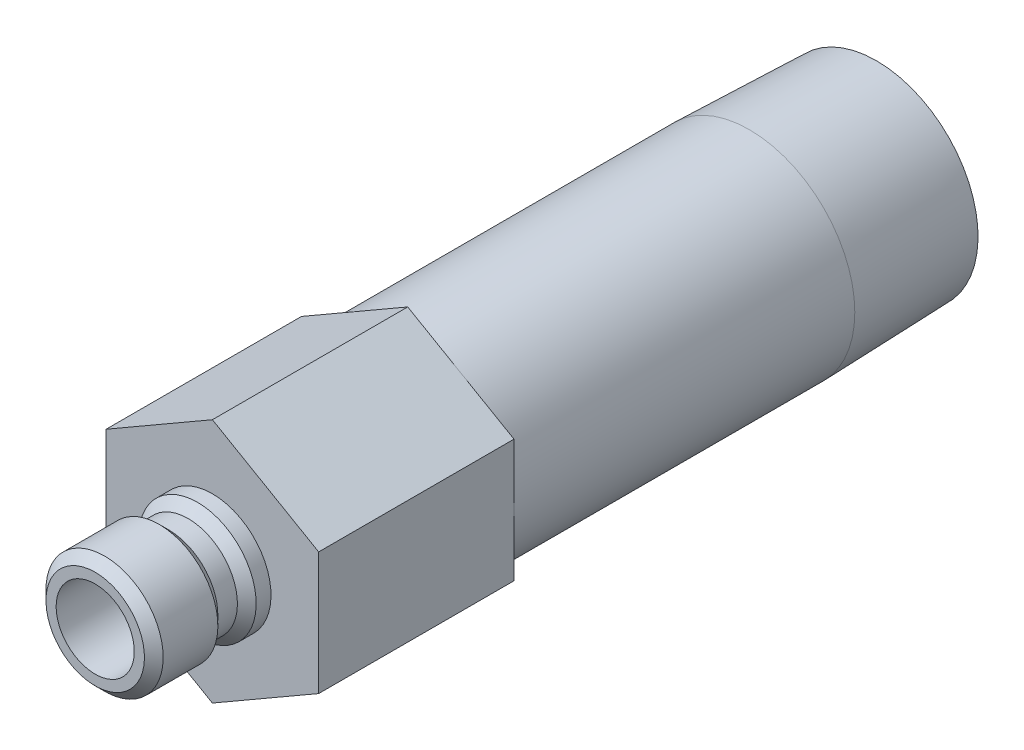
ISO-10303-21;
HEADER;
FILE_DESCRIPTION(('STEP AP214'),'2;1');
FILE_NAME('part.step','',(''),(''),'','','');
FILE_SCHEMA(('AUTOMOTIVE_DESIGN { 1 0 10303 214 1 1 1 1 }'));
ENDSEC;
DATA;
#1=APPLICATION_CONTEXT('core data for automotive mechanical design processes');
#2=APPLICATION_PROTOCOL_DEFINITION('international standard','automotive_design',2000,#1);
#3=PRODUCT_CONTEXT('',#1,'mechanical');
#4=PRODUCT('Part','Part','',(#3));
#5=PRODUCT_RELATED_PRODUCT_CATEGORY('part','',(#4));
#6=PRODUCT_DEFINITION_FORMATION('','',#4);
#7=PRODUCT_DEFINITION_CONTEXT('part definition',#1,'design');
#8=PRODUCT_DEFINITION('design','',#6,#7);
#9=PRODUCT_DEFINITION_SHAPE('','',#8);
#10=(LENGTH_UNIT() NAMED_UNIT(*) SI_UNIT(.MILLI.,.METRE.));
#11=(NAMED_UNIT(*) PLANE_ANGLE_UNIT() SI_UNIT($,.RADIAN.));
#12=(NAMED_UNIT(*) SI_UNIT($,.STERADIAN.) SOLID_ANGLE_UNIT());
#13=UNCERTAINTY_MEASURE_WITH_UNIT(LENGTH_MEASURE(1.E-05),#10,'distance_accuracy_value','');
#14=(GEOMETRIC_REPRESENTATION_CONTEXT(3) GLOBAL_UNCERTAINTY_ASSIGNED_CONTEXT((#13)) GLOBAL_UNIT_ASSIGNED_CONTEXT((#10,
#11,#12)) REPRESENTATION_CONTEXT('',''));
#15=CARTESIAN_POINT('',(0.,0.,0.));
#16=DIRECTION('',(0.,0.,1.));
#17=DIRECTION('',(1.,0.,0.));
#18=AXIS2_PLACEMENT_3D('',#15,#16,#17);
#19=CARTESIAN_POINT('',(0.,0.,0.));
#20=DIRECTION('',(0.,0.,-1.));
#21=DIRECTION('',(0.,1.,0.));
#22=AXIS2_PLACEMENT_3D('',#19,#20,#21);
#23=CYLINDRICAL_SURFACE('',#22,8.5725);
#24=CARTESIAN_POINT('',(0.,0.,-43.6372));
#25=DIRECTION('',(0.,0.,-1.));
#26=DIRECTION('',(0.,1.,0.));
#27=AXIS2_PLACEMENT_3D('',#24,#25,#26);
#28=CIRCLE('',#27,8.57249999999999);
#29=CARTESIAN_POINT('',(0.,8.5725,-43.6372));
#30=VERTEX_POINT('',#29);
#31=EDGE_CURVE('E168',#30,#30,#28,.T.);
#32=ORIENTED_EDGE('',*,*,#31,.F.);
#33=EDGE_LOOP('',(#32));
#34=FACE_BOUND('',#33,.T.);
#35=CARTESIAN_POINT('',(0.,0.,-15.875));
#36=DIRECTION('',(0.,0.,1.));
#37=DIRECTION('',(1.,0.,0.));
#38=AXIS2_PLACEMENT_3D('',#35,#36,#37);
#39=CIRCLE('',#38,8.5725);
#40=CARTESIAN_POINT('',(8.5725,0.,-15.875));
#41=VERTEX_POINT('',#40);
#42=EDGE_CURVE('E37',#41,#41,#39,.F.);
#43=ORIENTED_EDGE('',*,*,#42,.T.);
#44=EDGE_LOOP('',(#43));
#45=FACE_BOUND('',#44,.T.);
#46=ADVANCED_FACE('F33',(#34,#45),#23,.T.);
#47=CARTESIAN_POINT('',(0.,0.,0.));
#48=DIRECTION('',(0.,0.,-1.));
#49=DIRECTION('',(0.,1.,0.));
#50=AXIS2_PLACEMENT_3D('',#47,#48,#49);
#51=CYLINDRICAL_SURFACE('',#50,3.175);
#52=CARTESIAN_POINT('',(0.,0.,9.525));
#53=DIRECTION('',(0.,0.,-1.));
#54=DIRECTION('',(0.,1.,0.));
#55=AXIS2_PLACEMENT_3D('',#52,#53,#54);
#56=CIRCLE('',#55,3.175);
#57=CARTESIAN_POINT('',(0.,3.175,9.525));
#58=VERTEX_POINT('',#57);
#59=EDGE_CURVE('E144',#58,#58,#56,.T.);
#60=ORIENTED_EDGE('',*,*,#59,.F.);
#61=EDGE_LOOP('',(#60));
#62=FACE_BOUND('',#61,.T.);
#63=CARTESIAN_POINT('',(0.,0.,-15.875));
#64=DIRECTION('',(0.,0.,-1.));
#65=DIRECTION('',(0.,1.,0.));
#66=AXIS2_PLACEMENT_3D('',#63,#64,#65);
#67=CIRCLE('',#66,3.17499999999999);
#68=CARTESIAN_POINT('',(0.,3.175,-15.875));
#69=VERTEX_POINT('',#68);
#70=EDGE_CURVE('E11',#69,#69,#67,.T.);
#71=ORIENTED_EDGE('',*,*,#70,.T.);
#72=EDGE_LOOP('',(#71));
#73=FACE_BOUND('',#72,.T.);
#74=ADVANCED_FACE('F35',(#62,#73),#51,.F.);
#75=CARTESIAN_POINT('',(0.,3.175,-15.875));
#76=DIRECTION('',(0.,0.,-1.));
#77=DIRECTION('',(0.,1.,0.));
#78=AXIS2_PLACEMENT_3D('',#75,#76,#77);
#79=PLANE('',#78);
#80=CARTESIAN_POINT('',(0.,0.,-15.875));
#81=DIRECTION('',(0.,0.,-1.));
#82=DIRECTION('',(0.,1.,0.));
#83=AXIS2_PLACEMENT_3D('',#80,#81,#82);
#84=CIRCLE('',#83,6.2611);
#85=CARTESIAN_POINT('',(0.,6.2611,-15.875));
#86=VERTEX_POINT('',#85);
#87=EDGE_CURVE('E43',#86,#86,#84,.T.);
#88=ORIENTED_EDGE('',*,*,#87,.T.);
#89=EDGE_LOOP('',(#88));
#90=FACE_BOUND('',#89,.T.);
#91=ORIENTED_EDGE('',*,*,#70,.F.);
#92=EDGE_LOOP('',(#91));
#93=FACE_BOUND('',#92,.T.);
#94=ADVANCED_FACE('F180',(#90,#93),#79,.T.);
#95=CARTESIAN_POINT('',(0.,0.,0.));
#96=DIRECTION('',(0.,0.,-1.));
#97=DIRECTION('',(0.,1.,0.));
#98=AXIS2_PLACEMENT_3D('',#95,#96,#97);
#99=CYLINDRICAL_SURFACE('',#98,6.2611);
#100=CARTESIAN_POINT('',(0.,0.,-53.975));
#101=DIRECTION('',(0.,0.,-1.));
#102=DIRECTION('',(0.,1.,0.));
#103=AXIS2_PLACEMENT_3D('',#100,#101,#102);
#104=CIRCLE('',#103,6.26109999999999);
#105=CARTESIAN_POINT('',(0.,6.2611,-53.975));
#106=VERTEX_POINT('',#105);
#107=EDGE_CURVE('E174',#106,#106,#104,.T.);
#108=ORIENTED_EDGE('',*,*,#107,.T.);
#109=EDGE_LOOP('',(#108));
#110=FACE_BOUND('',#109,.T.);
#111=ORIENTED_EDGE('',*,*,#87,.F.);
#112=EDGE_LOOP('',(#111));
#113=FACE_BOUND('',#112,.T.);
#114=ADVANCED_FACE('F183',(#110,#113),#99,.F.);
#115=CARTESIAN_POINT('',(0.,8.24944566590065,-53.975));
#116=DIRECTION('',(0.,0.,-1.));
#117=DIRECTION('',(0.,1.,0.));
#118=AXIS2_PLACEMENT_3D('',#115,#116,#117);
#119=PLANE('',#118);
#120=CARTESIAN_POINT('',(0.,0.,-53.975));
#121=DIRECTION('',(0.,0.,-1.));
#122=DIRECTION('',(0.,1.,0.));
#123=AXIS2_PLACEMENT_3D('',#120,#121,#122);
#124=CIRCLE('',#123,8.24944566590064);
#125=CARTESIAN_POINT('',(0.,8.24944566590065,-53.975));
#126=VERTEX_POINT('',#125);
#127=EDGE_CURVE('E171',#126,#126,#124,.T.);
#128=ORIENTED_EDGE('',*,*,#127,.T.);
#129=EDGE_LOOP('',(#128));
#130=FACE_BOUND('',#129,.T.);
#131=ORIENTED_EDGE('',*,*,#107,.F.);
#132=EDGE_LOOP('',(#131));
#133=FACE_BOUND('',#132,.T.);
#134=ADVANCED_FACE('F185',(#130,#133),#119,.T.);
#135=CARTESIAN_POINT('',(0.,0.,-53.975));
#136=DIRECTION('',(0.,0.,1.));
#137=DIRECTION('',(0.,-1.,0.));
#138=AXIS2_PLACEMENT_3D('',#135,#136,#137);
#139=CONICAL_SURFACE('',#138,8.24944566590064,0.0312396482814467);
#140=ORIENTED_EDGE('',*,*,#31,.T.);
#141=EDGE_LOOP('',(#140));
#142=FACE_BOUND('',#141,.T.);
#143=ORIENTED_EDGE('',*,*,#127,.F.);
#144=EDGE_LOOP('',(#143));
#145=FACE_BOUND('',#144,.T.);
#146=ADVANCED_FACE('F192',(#142,#145),#139,.T.);
#147=CARTESIAN_POINT('',(0.,4.7625,0.));
#148=DIRECTION('',(0.,0.,1.));
#149=DIRECTION('',(0.,-1.,0.));
#150=AXIS2_PLACEMENT_3D('',#147,#148,#149);
#151=PLANE('',#150);
#152=CARTESIAN_POINT('',(0.,0.,0.));
#153=DIRECTION('',(0.,0.,-1.));
#154=DIRECTION('',(0.,1.,0.));
#155=AXIS2_PLACEMENT_3D('',#152,#153,#154);
#156=CIRCLE('',#155,4.7625);
#157=CARTESIAN_POINT('',(0.,4.7625,0.));
#158=VERTEX_POINT('',#157);
#159=EDGE_CURVE('E165',#158,#158,#156,.T.);
#160=ORIENTED_EDGE('',*,*,#159,.T.);
#161=EDGE_LOOP('',(#160));
#162=FACE_BOUND('',#161,.T.);
#163=DIRECTION('',(-0.866025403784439,-0.5,0.));
#164=VECTOR('',#163,1.);
#165=CARTESIAN_POINT('',(0.,9.97199384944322,0.));
#166=LINE('',#165,#164);
#167=CARTESIAN_POINT('',(0.,9.97199384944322,0.));
#168=VERTEX_POINT('',#167);
#169=CARTESIAN_POINT('',(-8.636,4.98599692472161,0.));
#170=VERTEX_POINT('',#169);
#171=EDGE_CURVE('E122',#168,#170,#166,.T.);
#172=ORIENTED_EDGE('',*,*,#171,.T.);
#173=DIRECTION('',(0.,-1.,0.));
#174=VECTOR('',#173,1.);
#175=CARTESIAN_POINT('',(-8.636,4.98599692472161,0.));
#176=LINE('',#175,#174);
#177=CARTESIAN_POINT('',(-8.636,-4.98599692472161,0.));
#178=VERTEX_POINT('',#177);
#179=EDGE_CURVE('E125',#170,#178,#176,.T.);
#180=ORIENTED_EDGE('',*,*,#179,.T.);
#181=DIRECTION('',(0.866025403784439,-0.5,0.));
#182=VECTOR('',#181,1.);
#183=CARTESIAN_POINT('',(-8.636,-4.98599692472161,0.));
#184=LINE('',#183,#182);
#185=CARTESIAN_POINT('',(0.,-9.97199384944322,0.));
#186=VERTEX_POINT('',#185);
#187=EDGE_CURVE('E128',#178,#186,#184,.T.);
#188=ORIENTED_EDGE('',*,*,#187,.T.);
#189=DIRECTION('',(0.866025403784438,0.5,0.));
#190=VECTOR('',#189,1.);
#191=CARTESIAN_POINT('',(0.,-9.97199384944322,0.));
#192=LINE('',#191,#190);
#193=CARTESIAN_POINT('',(8.636,-4.98599692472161,0.));
#194=VERTEX_POINT('',#193);
#195=EDGE_CURVE('E131',#186,#194,#192,.T.);
#196=ORIENTED_EDGE('',*,*,#195,.T.);
#197=DIRECTION('',(0.,1.,0.));
#198=VECTOR('',#197,1.);
#199=CARTESIAN_POINT('',(8.636,-4.98599692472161,0.));
#200=LINE('',#199,#198);
#201=CARTESIAN_POINT('',(8.636,4.98599692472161,0.));
#202=VERTEX_POINT('',#201);
#203=EDGE_CURVE('E99',#194,#202,#200,.T.);
#204=ORIENTED_EDGE('',*,*,#203,.T.);
#205=DIRECTION('',(-0.866025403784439,0.5,0.));
#206=VECTOR('',#205,1.);
#207=CARTESIAN_POINT('',(8.636,4.98599692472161,0.));
#208=LINE('',#207,#206);
#209=EDGE_CURVE('E134',#202,#168,#208,.T.);
#210=ORIENTED_EDGE('',*,*,#209,.T.);
#211=EDGE_LOOP('',(#172,#180,#188,#196,#204,#210));
#212=FACE_BOUND('',#211,.T.);
#213=ADVANCED_FACE('F206',(#162,#212),#151,.T.);
#214=CARTESIAN_POINT('',(0.,0.,0.));
#215=DIRECTION('',(0.,0.,-1.));
#216=DIRECTION('',(0.,1.,0.));
#217=AXIS2_PLACEMENT_3D('',#214,#215,#216);
#218=CYLINDRICAL_SURFACE('',#217,4.7625);
#219=CARTESIAN_POINT('',(0.,0.,1.2065));
#220=DIRECTION('',(0.,0.,-1.));
#221=DIRECTION('',(0.,1.,0.));
#222=AXIS2_PLACEMENT_3D('',#219,#220,#221);
#223=CIRCLE('',#222,4.7625);
#224=CARTESIAN_POINT('',(0.,4.7625,1.2065));
#225=VERTEX_POINT('',#224);
#226=EDGE_CURVE('E162',#225,#225,#223,.T.);
#227=ORIENTED_EDGE('',*,*,#226,.T.);
#228=EDGE_LOOP('',(#227));
#229=FACE_BOUND('',#228,.T.);
#230=ORIENTED_EDGE('',*,*,#159,.F.);
#231=EDGE_LOOP('',(#230));
#232=FACE_BOUND('',#231,.T.);
#233=ADVANCED_FACE('F213',(#229,#232),#218,.T.);
#234=CARTESIAN_POINT('',(0.,0.,1.2065));
#235=DIRECTION('',(0.,0.,-1.));
#236=DIRECTION('',(0.,1.,0.));
#237=AXIS2_PLACEMENT_3D('',#234,#235,#236);
#238=CONICAL_SURFACE('',#237,4.7625,0.785398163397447);
#239=CARTESIAN_POINT('',(0.,0.,1.9685));
#240=DIRECTION('',(0.,0.,-1.));
#241=DIRECTION('',(0.,1.,0.));
#242=AXIS2_PLACEMENT_3D('',#239,#240,#241);
#243=CIRCLE('',#242,4.0005);
#244=CARTESIAN_POINT('',(0.,4.0005,1.9685));
#245=VERTEX_POINT('',#244);
#246=EDGE_CURVE('E159',#245,#245,#243,.T.);
#247=ORIENTED_EDGE('',*,*,#246,.T.);
#248=EDGE_LOOP('',(#247));
#249=FACE_BOUND('',#248,.T.);
#250=ORIENTED_EDGE('',*,*,#226,.F.);
#251=EDGE_LOOP('',(#250));
#252=FACE_BOUND('',#251,.T.);
#253=ADVANCED_FACE('F222',(#249,#252),#238,.T.);
#254=CARTESIAN_POINT('',(0.,0.,0.));
#255=DIRECTION('',(0.,0.,-1.));
#256=DIRECTION('',(0.,1.,0.));
#257=AXIS2_PLACEMENT_3D('',#254,#255,#256);
#258=CYLINDRICAL_SURFACE('',#257,4.0005);
#259=CARTESIAN_POINT('',(0.,0.,3.556));
#260=DIRECTION('',(0.,0.,-1.));
#261=DIRECTION('',(0.,1.,0.));
#262=AXIS2_PLACEMENT_3D('',#259,#260,#261);
#263=CIRCLE('',#262,4.0005);
#264=CARTESIAN_POINT('',(0.,4.0005,3.556));
#265=VERTEX_POINT('',#264);
#266=EDGE_CURVE('E156',#265,#265,#263,.T.);
#267=ORIENTED_EDGE('',*,*,#266,.T.);
#268=EDGE_LOOP('',(#267));
#269=FACE_BOUND('',#268,.T.);
#270=ORIENTED_EDGE('',*,*,#246,.F.);
#271=EDGE_LOOP('',(#270));
#272=FACE_BOUND('',#271,.T.);
#273=ADVANCED_FACE('F263',(#269,#272),#258,.T.);
#274=CARTESIAN_POINT('',(0.,0.,3.556));
#275=DIRECTION('',(0.,0.,1.));
#276=DIRECTION('',(0.,-1.,0.));
#277=AXIS2_PLACEMENT_3D('',#274,#275,#276);
#278=CONICAL_SURFACE('',#277,4.0005,0.785398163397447);
#279=CARTESIAN_POINT('',(0.,0.,4.318));
#280=DIRECTION('',(0.,0.,-1.));
#281=DIRECTION('',(0.,1.,0.));
#282=AXIS2_PLACEMENT_3D('',#279,#280,#281);
#283=CIRCLE('',#282,4.7625);
#284=CARTESIAN_POINT('',(0.,4.7625,4.318));
#285=VERTEX_POINT('',#284);
#286=EDGE_CURVE('E153',#285,#285,#283,.T.);
#287=ORIENTED_EDGE('',*,*,#286,.T.);
#288=EDGE_LOOP('',(#287));
#289=FACE_BOUND('',#288,.T.);
#290=ORIENTED_EDGE('',*,*,#266,.F.);
#291=EDGE_LOOP('',(#290));
#292=FACE_BOUND('',#291,.T.);
#293=ADVANCED_FACE('F259',(#289,#292),#278,.T.);
#294=CARTESIAN_POINT('',(0.,0.,0.));
#295=DIRECTION('',(0.,0.,-1.));
#296=DIRECTION('',(0.,1.,0.));
#297=AXIS2_PLACEMENT_3D('',#294,#295,#296);
#298=CYLINDRICAL_SURFACE('',#297,4.7625);
#299=CARTESIAN_POINT('',(0.,0.,8.763));
#300=DIRECTION('',(0.,0.,-1.));
#301=DIRECTION('',(0.,1.,0.));
#302=AXIS2_PLACEMENT_3D('',#299,#300,#301);
#303=CIRCLE('',#302,4.7625);
#304=CARTESIAN_POINT('',(0.,4.7625,8.763));
#305=VERTEX_POINT('',#304);
#306=EDGE_CURVE('E150',#305,#305,#303,.T.);
#307=ORIENTED_EDGE('',*,*,#306,.T.);
#308=EDGE_LOOP('',(#307));
#309=FACE_BOUND('',#308,.T.);
#310=ORIENTED_EDGE('',*,*,#286,.F.);
#311=EDGE_LOOP('',(#310));
#312=FACE_BOUND('',#311,.T.);
#313=ADVANCED_FACE('F255',(#309,#312),#298,.T.);
#314=CARTESIAN_POINT('',(0.,0.,8.763));
#315=DIRECTION('',(0.,0.,-1.));
#316=DIRECTION('',(0.,1.,0.));
#317=AXIS2_PLACEMENT_3D('',#314,#315,#316);
#318=CONICAL_SURFACE('',#317,4.7625,0.785398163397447);
#319=CARTESIAN_POINT('',(0.,0.,9.525));
#320=DIRECTION('',(0.,0.,-1.));
#321=DIRECTION('',(0.,1.,0.));
#322=AXIS2_PLACEMENT_3D('',#319,#320,#321);
#323=CIRCLE('',#322,4.0005);
#324=CARTESIAN_POINT('',(0.,4.0005,9.525));
#325=VERTEX_POINT('',#324);
#326=EDGE_CURVE('E147',#325,#325,#323,.T.);
#327=ORIENTED_EDGE('',*,*,#326,.T.);
#328=EDGE_LOOP('',(#327));
#329=FACE_BOUND('',#328,.T.);
#330=ORIENTED_EDGE('',*,*,#306,.F.);
#331=EDGE_LOOP('',(#330));
#332=FACE_BOUND('',#331,.T.);
#333=ADVANCED_FACE('F251',(#329,#332),#318,.T.);
#334=CARTESIAN_POINT('',(0.,3.175,9.525));
#335=DIRECTION('',(0.,0.,1.));
#336=DIRECTION('',(0.,-1.,0.));
#337=AXIS2_PLACEMENT_3D('',#334,#335,#336);
#338=PLANE('',#337);
#339=ORIENTED_EDGE('',*,*,#59,.T.);
#340=EDGE_LOOP('',(#339));
#341=FACE_BOUND('',#340,.T.);
#342=ORIENTED_EDGE('',*,*,#326,.F.);
#343=EDGE_LOOP('',(#342));
#344=FACE_BOUND('',#343,.T.);
#345=ADVANCED_FACE('F239',(#341,#344),#338,.T.);
#346=CARTESIAN_POINT('',(0.,9.97199384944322,-15.875));
#347=DIRECTION('',(-0.5,0.866025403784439,0.));
#348=DIRECTION('',(-0.866025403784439,-0.5,0.));
#349=AXIS2_PLACEMENT_3D('',#346,#347,#348);
#350=PLANE('',#349);
#351=ORIENTED_EDGE('',*,*,#171,.F.);
#352=DIRECTION('',(0.,0.,1.));
#353=VECTOR('',#352,1.);
#354=CARTESIAN_POINT('',(0.,9.97199384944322,-15.875));
#355=LINE('',#354,#353);
#356=CARTESIAN_POINT('',(0.,9.97199384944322,-15.875));
#357=VERTEX_POINT('',#356);
#358=EDGE_CURVE('E51',#357,#168,#355,.T.);
#359=ORIENTED_EDGE('',*,*,#358,.F.);
#360=DIRECTION('',(-0.866025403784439,-0.5,0.));
#361=VECTOR('',#360,1.);
#362=CARTESIAN_POINT('',(0.,9.97199384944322,-15.875));
#363=LINE('',#362,#361);
#364=CARTESIAN_POINT('',(-8.636,4.98599692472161,-15.875));
#365=VERTEX_POINT('',#364);
#366=EDGE_CURVE('E137',#357,#365,#363,.T.);
#367=ORIENTED_EDGE('',*,*,#366,.T.);
#368=DIRECTION('',(0.,0.,1.));
#369=VECTOR('',#368,1.);
#370=CARTESIAN_POINT('',(-8.636,4.98599692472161,-15.875));
#371=LINE('',#370,#369);
#372=EDGE_CURVE('E86',#365,#170,#371,.T.);
#373=ORIENTED_EDGE('',*,*,#372,.T.);
#374=EDGE_LOOP('',(#351,#359,#367,#373));
#375=FACE_BOUND('',#374,.T.);
#376=ADVANCED_FACE('F226',(#375),#350,.T.);
#377=CARTESIAN_POINT('',(8.636,4.98599692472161,-15.875));
#378=DIRECTION('',(0.5,0.866025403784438,0.));
#379=DIRECTION('',(-0.866025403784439,0.5,0.));
#380=AXIS2_PLACEMENT_3D('',#377,#378,#379);
#381=PLANE('',#380);
#382=ORIENTED_EDGE('',*,*,#209,.F.);
#383=DIRECTION('',(0.,0.,1.));
#384=VECTOR('',#383,1.);
#385=CARTESIAN_POINT('',(8.636,4.98599692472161,-15.875));
#386=LINE('',#385,#384);
#387=CARTESIAN_POINT('',(8.636,4.98599692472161,-15.875));
#388=VERTEX_POINT('',#387);
#389=EDGE_CURVE('E74',#388,#202,#386,.T.);
#390=ORIENTED_EDGE('',*,*,#389,.F.);
#391=DIRECTION('',(-0.866025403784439,0.5,0.));
#392=VECTOR('',#391,1.);
#393=CARTESIAN_POINT('',(8.636,4.98599692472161,-15.875));
#394=LINE('',#393,#392);
#395=EDGE_CURVE('E112',#388,#357,#394,.T.);
#396=ORIENTED_EDGE('',*,*,#395,.T.);
#397=ORIENTED_EDGE('',*,*,#358,.T.);
#398=EDGE_LOOP('',(#382,#390,#396,#397));
#399=FACE_BOUND('',#398,.T.);
#400=ADVANCED_FACE('F231',(#399),#381,.T.);
#401=CARTESIAN_POINT('',(8.636,-4.98599692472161,-15.875));
#402=DIRECTION('',(1.,0.,0.));
#403=DIRECTION('',(0.,1.,0.));
#404=AXIS2_PLACEMENT_3D('',#401,#402,#403);
#405=PLANE('',#404);
#406=ORIENTED_EDGE('',*,*,#203,.F.);
#407=DIRECTION('',(0.,0.,1.));
#408=VECTOR('',#407,1.);
#409=CARTESIAN_POINT('',(8.636,-4.98599692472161,-15.875));
#410=LINE('',#409,#408);
#411=CARTESIAN_POINT('',(8.636,-4.98599692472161,-15.875));
#412=VERTEX_POINT('',#411);
#413=EDGE_CURVE('E94',#412,#194,#410,.T.);
#414=ORIENTED_EDGE('',*,*,#413,.F.);
#415=DIRECTION('',(0.,1.,0.));
#416=VECTOR('',#415,1.);
#417=CARTESIAN_POINT('',(8.636,-4.98599692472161,-15.875));
#418=LINE('',#417,#416);
#419=EDGE_CURVE('E97',#412,#388,#418,.T.);
#420=ORIENTED_EDGE('',*,*,#419,.T.);
#421=ORIENTED_EDGE('',*,*,#389,.T.);
#422=EDGE_LOOP('',(#406,#414,#420,#421));
#423=FACE_BOUND('',#422,.T.);
#424=ADVANCED_FACE('F96',(#423),#405,.T.);
#425=CARTESIAN_POINT('',(0.,-9.97199384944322,-15.875));
#426=DIRECTION('',(0.5,-0.866025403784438,0.));
#427=DIRECTION('',(0.866025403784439,0.5,0.));
#428=AXIS2_PLACEMENT_3D('',#425,#426,#427);
#429=PLANE('',#428);
#430=ORIENTED_EDGE('',*,*,#195,.F.);
#431=DIRECTION('',(0.,0.,1.));
#432=VECTOR('',#431,1.);
#433=CARTESIAN_POINT('',(0.,-9.97199384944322,-15.875));
#434=LINE('',#433,#432);
#435=CARTESIAN_POINT('',(0.,-9.97199384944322,-15.875));
#436=VERTEX_POINT('',#435);
#437=EDGE_CURVE('E104',#436,#186,#434,.T.);
#438=ORIENTED_EDGE('',*,*,#437,.F.);
#439=DIRECTION('',(0.866025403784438,0.5,0.));
#440=VECTOR('',#439,1.);
#441=CARTESIAN_POINT('',(0.,-9.97199384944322,-15.875));
#442=LINE('',#441,#440);
#443=EDGE_CURVE('E110',#436,#412,#442,.T.);
#444=ORIENTED_EDGE('',*,*,#443,.T.);
#445=ORIENTED_EDGE('',*,*,#413,.T.);
#446=EDGE_LOOP('',(#430,#438,#444,#445));
#447=FACE_BOUND('',#446,.T.);
#448=ADVANCED_FACE('F114',(#447),#429,.T.);
#449=CARTESIAN_POINT('',(-8.636,-4.98599692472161,-15.875));
#450=DIRECTION('',(-0.5,-0.866025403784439,0.));
#451=DIRECTION('',(0.866025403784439,-0.5,0.));
#452=AXIS2_PLACEMENT_3D('',#449,#450,#451);
#453=PLANE('',#452);
#454=ORIENTED_EDGE('',*,*,#187,.F.);
#455=DIRECTION('',(0.,0.,1.));
#456=VECTOR('',#455,1.);
#457=CARTESIAN_POINT('',(-8.636,-4.98599692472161,-15.875));
#458=LINE('',#457,#456);
#459=CARTESIAN_POINT('',(-8.636,-4.98599692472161,-15.875));
#460=VERTEX_POINT('',#459);
#461=EDGE_CURVE('E141',#460,#178,#458,.T.);
#462=ORIENTED_EDGE('',*,*,#461,.F.);
#463=DIRECTION('',(0.866025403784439,-0.5,0.));
#464=VECTOR('',#463,1.);
#465=CARTESIAN_POINT('',(-8.636,-4.98599692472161,-15.875));
#466=LINE('',#465,#464);
#467=EDGE_CURVE('E115',#460,#436,#466,.T.);
#468=ORIENTED_EDGE('',*,*,#467,.T.);
#469=ORIENTED_EDGE('',*,*,#437,.T.);
#470=EDGE_LOOP('',(#454,#462,#468,#469));
#471=FACE_BOUND('',#470,.T.);
#472=ADVANCED_FACE('F230',(#471),#453,.T.);
#473=CARTESIAN_POINT('',(-8.636,4.98599692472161,-15.875));
#474=DIRECTION('',(-1.,0.,0.));
#475=DIRECTION('',(0.,0.,1.));
#476=AXIS2_PLACEMENT_3D('',#473,#474,#475);
#477=PLANE('',#476);
#478=ORIENTED_EDGE('',*,*,#179,.F.);
#479=ORIENTED_EDGE('',*,*,#372,.F.);
#480=DIRECTION('',(0.,-1.,0.));
#481=VECTOR('',#480,1.);
#482=CARTESIAN_POINT('',(-8.636,4.98599692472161,-15.875));
#483=LINE('',#482,#481);
#484=EDGE_CURVE('E117',#365,#460,#483,.T.);
#485=ORIENTED_EDGE('',*,*,#484,.T.);
#486=ORIENTED_EDGE('',*,*,#461,.T.);
#487=EDGE_LOOP('',(#478,#479,#485,#486));
#488=FACE_BOUND('',#487,.T.);
#489=ADVANCED_FACE('F227',(#488),#477,.T.);
#490=CARTESIAN_POINT('',(-8.636,4.98599692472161,-15.875));
#491=DIRECTION('',(0.,0.,1.));
#492=DIRECTION('',(1.,0.,0.));
#493=AXIS2_PLACEMENT_3D('',#490,#491,#492);
#494=PLANE('',#493);
#495=ORIENTED_EDGE('',*,*,#42,.F.);
#496=EDGE_LOOP('',(#495));
#497=FACE_BOUND('',#496,.T.);
#498=ORIENTED_EDGE('',*,*,#366,.F.);
#499=ORIENTED_EDGE('',*,*,#395,.F.);
#500=ORIENTED_EDGE('',*,*,#419,.F.);
#501=ORIENTED_EDGE('',*,*,#443,.F.);
#502=ORIENTED_EDGE('',*,*,#467,.F.);
#503=ORIENTED_EDGE('',*,*,#484,.F.);
#504=EDGE_LOOP('',(#498,#499,#500,#501,#502,#503));
#505=FACE_BOUND('',#504,.T.);
#506=ADVANCED_FACE('F108',(#497,#505),#494,.F.);
#507=CLOSED_SHELL('',(#46,#74,#94,#114,#134,#146,#213,#233,#253,#273,#293,#313,#333,#345,#376,
#400,#424,#448,#472,#489,#506));
#508=MANIFOLD_SOLID_BREP('B2',#507);
#509=ADVANCED_BREP_SHAPE_REPRESENTATION('',(#18,#508),#14);
#510=SHAPE_DEFINITION_REPRESENTATION(#9,#509);
ENDSEC;
END-ISO-10303-21;
